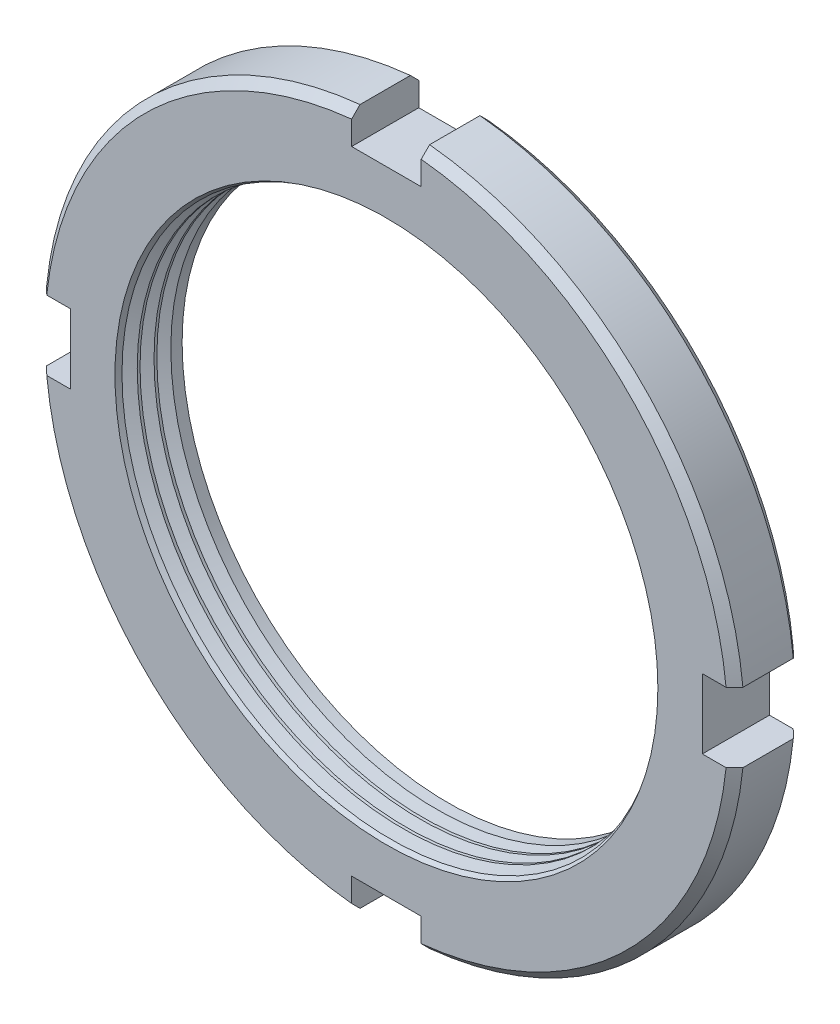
ISO-10303-21;
HEADER;
FILE_DESCRIPTION(('STEP AP214'),'2;1');
FILE_NAME('part.step','',(''),(''),'','','');
FILE_SCHEMA(('AUTOMOTIVE_DESIGN { 1 0 10303 214 1 1 1 1 }'));
ENDSEC;
DATA;
#1=APPLICATION_CONTEXT('core data for automotive mechanical design processes');
#2=APPLICATION_PROTOCOL_DEFINITION('international standard','automotive_design',2000,#1);
#3=PRODUCT_CONTEXT('',#1,'mechanical');
#4=PRODUCT('Part','Part','',(#3));
#5=PRODUCT_RELATED_PRODUCT_CATEGORY('part','',(#4));
#6=PRODUCT_DEFINITION_FORMATION('','',#4);
#7=PRODUCT_DEFINITION_CONTEXT('part definition',#1,'design');
#8=PRODUCT_DEFINITION('design','',#6,#7);
#9=PRODUCT_DEFINITION_SHAPE('','',#8);
#10=(LENGTH_UNIT() NAMED_UNIT(*) SI_UNIT(.MILLI.,.METRE.));
#11=(NAMED_UNIT(*) PLANE_ANGLE_UNIT() SI_UNIT($,.RADIAN.));
#12=(NAMED_UNIT(*) SI_UNIT($,.STERADIAN.) SOLID_ANGLE_UNIT());
#13=UNCERTAINTY_MEASURE_WITH_UNIT(LENGTH_MEASURE(1.E-05),#10,'distance_accuracy_value','');
#14=(GEOMETRIC_REPRESENTATION_CONTEXT(3) GLOBAL_UNCERTAINTY_ASSIGNED_CONTEXT((#13)) GLOBAL_UNIT_ASSIGNED_CONTEXT((#10,
#11,#12)) REPRESENTATION_CONTEXT('',''));
#15=CARTESIAN_POINT('',(0.,0.,0.));
#16=DIRECTION('',(0.,0.,1.));
#17=DIRECTION('',(1.,0.,0.));
#18=AXIS2_PLACEMENT_3D('',#15,#16,#17);
#19=CARTESIAN_POINT('',(0.,0.,-12.));
#20=DIRECTION('',(0.,0.,1.));
#21=DIRECTION('',(1.,0.,0.));
#22=AXIS2_PLACEMENT_3D('',#19,#20,#21);
#23=CYLINDRICAL_SURFACE('',#22,47.5);
#24=CARTESIAN_POINT('',(0.,0.,-5.98205080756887));
#25=DIRECTION('',(0.,0.,-1.));
#26=DIRECTION('',(-1.,0.,0.));
#27=AXIS2_PLACEMENT_3D('',#24,#25,#26);
#28=CIRCLE('',#27,47.5);
#29=CARTESIAN_POINT('',(-47.5,0.,-5.98205080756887));
#30=VERTEX_POINT('',#29);
#31=EDGE_CURVE('E596',#30,#30,#28,.T.);
#32=ORIENTED_EDGE('',*,*,#31,.F.);
#33=EDGE_LOOP('',(#32));
#34=FACE_BOUND('',#33,.T.);
#35=CARTESIAN_POINT('',(0.,0.,-6.48205080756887));
#36=DIRECTION('',(0.,0.,-1.));
#37=DIRECTION('',(-1.,0.,0.));
#38=AXIS2_PLACEMENT_3D('',#35,#36,#37);
#39=CIRCLE('',#38,47.5);
#40=CARTESIAN_POINT('',(-47.5,0.,-6.48205080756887));
#41=VERTEX_POINT('',#40);
#42=EDGE_CURVE('E601',#41,#41,#39,.T.);
#43=ORIENTED_EDGE('',*,*,#42,.T.);
#44=EDGE_LOOP('',(#43));
#45=FACE_BOUND('',#44,.T.);
#46=ADVANCED_FACE('F34',(#34,#45),#23,.F.);
#47=CARTESIAN_POINT('',(0.,0.,-11.));
#48=DIRECTION('',(0.,0.,1.));
#49=DIRECTION('',(1.,0.,0.));
#50=AXIS2_PLACEMENT_3D('',#47,#48,#49);
#51=CIRCLE('',#50,47.5);
#52=CARTESIAN_POINT('',(47.5,0.,-11.));
#53=VERTEX_POINT('',#52);
#54=EDGE_CURVE('E422',#53,#53,#51,.F.);
#55=ORIENTED_EDGE('',*,*,#54,.T.);
#56=EDGE_LOOP('',(#55));
#57=FACE_BOUND('',#56,.T.);
#58=CARTESIAN_POINT('',(0.,0.,-8.98205080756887));
#59=DIRECTION('',(0.,0.,-1.));
#60=DIRECTION('',(-1.,0.,0.));
#61=AXIS2_PLACEMENT_3D('',#58,#59,#60);
#62=CIRCLE('',#61,47.5);
#63=CARTESIAN_POINT('',(-47.5,0.,-8.98205080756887));
#64=VERTEX_POINT('',#63);
#65=EDGE_CURVE('E607',#64,#64,#62,.T.);
#66=ORIENTED_EDGE('',*,*,#65,.F.);
#67=EDGE_LOOP('',(#66));
#68=FACE_BOUND('',#67,.T.);
#69=ADVANCED_FACE('F571',(#57,#68),#23,.F.);
#70=CARTESIAN_POINT('',(0.,0.,-2.98205080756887));
#71=DIRECTION('',(0.,0.,-1.));
#72=DIRECTION('',(-1.,0.,0.));
#73=AXIS2_PLACEMENT_3D('',#70,#71,#72);
#74=CIRCLE('',#73,47.5);
#75=CARTESIAN_POINT('',(-47.5,0.,-2.98205080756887));
#76=VERTEX_POINT('',#75);
#77=EDGE_CURVE('E588',#76,#76,#74,.T.);
#78=ORIENTED_EDGE('',*,*,#77,.F.);
#79=EDGE_LOOP('',(#78));
#80=FACE_BOUND('',#79,.T.);
#81=CARTESIAN_POINT('',(0.,0.,-3.48205080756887));
#82=DIRECTION('',(0.,0.,-1.));
#83=DIRECTION('',(-1.,0.,0.));
#84=AXIS2_PLACEMENT_3D('',#81,#82,#83);
#85=CIRCLE('',#84,47.5);
#86=CARTESIAN_POINT('',(-47.5,0.,-3.48205080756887));
#87=VERTEX_POINT('',#86);
#88=EDGE_CURVE('E591',#87,#87,#85,.T.);
#89=ORIENTED_EDGE('',*,*,#88,.T.);
#90=EDGE_LOOP('',(#89));
#91=FACE_BOUND('',#90,.T.);
#92=ADVANCED_FACE('F565',(#80,#91),#23,.F.);
#93=CARTESIAN_POINT('',(0.,0.,-1.73205080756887));
#94=DIRECTION('',(0.,0.,1.));
#95=DIRECTION('',(1.,0.,0.));
#96=AXIS2_PLACEMENT_3D('',#93,#94,#95);
#97=CONICAL_SURFACE('',#96,47.5,0.523598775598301);
#98=CARTESIAN_POINT('',(0.,0.,0.));
#99=DIRECTION('',(0.,0.,1.));
#100=DIRECTION('',(1.,0.,0.));
#101=AXIS2_PLACEMENT_3D('',#98,#99,#100);
#102=CIRCLE('',#101,48.5);
#103=CARTESIAN_POINT('',(48.5,0.,0.));
#104=VERTEX_POINT('',#103);
#105=EDGE_CURVE('E426',#104,#104,#102,.F.);
#106=ORIENTED_EDGE('',*,*,#105,.F.);
#107=EDGE_LOOP('',(#106));
#108=FACE_BOUND('',#107,.T.);
#109=CARTESIAN_POINT('',(0.,0.,-0.794550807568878));
#110=DIRECTION('',(0.,0.,-1.));
#111=DIRECTION('',(-1.,0.,0.));
#112=AXIS2_PLACEMENT_3D('',#109,#110,#111);
#113=CIRCLE('',#112,48.0412658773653);
#114=CARTESIAN_POINT('',(-48.0412658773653,0.,-0.794550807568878));
#115=VERTEX_POINT('',#114);
#116=EDGE_CURVE('E38',#115,#115,#113,.T.);
#117=ORIENTED_EDGE('',*,*,#116,.T.);
#118=EDGE_LOOP('',(#117));
#119=FACE_BOUND('',#118,.T.);
#120=ADVANCED_FACE('F281',(#108,#119),#97,.F.);
#121=CARTESIAN_POINT('',(0.,0.,-12.));
#122=DIRECTION('',(0.,0.,1.));
#123=DIRECTION('',(1.,0.,0.));
#124=AXIS2_PLACEMENT_3D('',#121,#122,#123);
#125=CYLINDRICAL_SURFACE('',#124,62.5);
#126=DIRECTION('',(0.,0.,1.));
#127=VECTOR('',#126,1.);
#128=CARTESIAN_POINT('',(62.19022250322,-6.21499999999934,-12.));
#129=LINE('',#128,#127);
#130=CARTESIAN_POINT('',(62.19022250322,-6.21499999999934,-10.4999999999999));
#131=VERTEX_POINT('',#130);
#132=CARTESIAN_POINT('',(62.19022250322,-6.21499999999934,-1.49999999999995));
#133=VERTEX_POINT('',#132);
#134=EDGE_CURVE('E232',#131,#133,#129,.T.);
#135=ORIENTED_EDGE('',*,*,#134,.T.);
#136=CARTESIAN_POINT('',(0.,0.,-1.49999999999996));
#137=DIRECTION('',(0.,0.,1.));
#138=DIRECTION('',(1.,0.,0.));
#139=AXIS2_PLACEMENT_3D('',#136,#137,#138);
#140=CIRCLE('',#139,62.5);
#141=CARTESIAN_POINT('',(6.21500000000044,-62.1902225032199,-1.49999999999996));
#142=VERTEX_POINT('',#141);
#143=EDGE_CURVE('E58',#133,#142,#140,.F.);
#144=ORIENTED_EDGE('',*,*,#143,.T.);
#145=DIRECTION('',(0.,0.,1.));
#146=VECTOR('',#145,1.);
#147=CARTESIAN_POINT('',(6.21500000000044,-62.1902225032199,-12.));
#148=LINE('',#147,#146);
#149=CARTESIAN_POINT('',(6.21500000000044,-62.1902225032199,-10.4999999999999));
#150=VERTEX_POINT('',#149);
#151=EDGE_CURVE('E338',#150,#142,#148,.T.);
#152=ORIENTED_EDGE('',*,*,#151,.F.);
#153=CARTESIAN_POINT('',(0.,0.,-10.4999999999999));
#154=DIRECTION('',(0.,0.,1.));
#155=DIRECTION('',(1.,0.,0.));
#156=AXIS2_PLACEMENT_3D('',#153,#154,#155);
#157=CIRCLE('',#156,62.5);
#158=EDGE_CURVE('E535',#150,#131,#157,.T.);
#159=ORIENTED_EDGE('',*,*,#158,.T.);
#160=EDGE_LOOP('',(#135,#144,#152,#159));
#161=FACE_BOUND('',#160,.T.);
#162=ADVANCED_FACE('F559',(#161),#125,.T.);
#163=CARTESIAN_POINT('',(0.,0.,-10.4999999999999));
#164=DIRECTION('',(0.,0.,1.));
#165=DIRECTION('',(1.,0.,0.));
#166=AXIS2_PLACEMENT_3D('',#163,#164,#165);
#167=CONICAL_SURFACE('',#166,62.5,0.785398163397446);
#168=CARTESIAN_POINT('',(68.7302677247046,-6.21499999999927,-3.98930570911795));
#169=CARTESIAN_POINT('',(67.3974966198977,-6.21499999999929,-5.31665587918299));
#170=CARTESIAN_POINT('',(66.0645740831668,-6.2149999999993,-6.64385403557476));
#171=CARTESIAN_POINT('',(63.398353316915,-6.21499999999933,-9.29787259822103));
#172=CARTESIAN_POINT('',(62.0650550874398,-6.21499999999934,-10.6246930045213));
#173=CARTESIAN_POINT('',(59.3980097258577,-6.21499999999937,-13.2778827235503));
#174=CARTESIAN_POINT('',(58.0642625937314,-6.21499999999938,-14.6042520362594));
#175=CARTESIAN_POINT('',(55.396210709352,-6.21499999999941,-17.2564300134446));
#176=CARTESIAN_POINT('',(54.0619059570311,-6.21499999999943,-18.5822386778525));
#177=CARTESIAN_POINT('',(52.7272681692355,-6.21499999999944,-19.9077121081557));
#178=B_SPLINE_CURVE_WITH_KNOTS('',3,(#168,#169,#170,#171,#172,#173,#174,#175,#176,#177),
.UNSPECIFIED.,.F.,.F.,(4,2,2,2,4),(0.,5.64298111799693,11.2859615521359,16.9289422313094,
22.5719235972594),.UNSPECIFIED.);
#179=CARTESIAN_POINT('',(60.6825656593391,-6.21499999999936,-12.));
#180=VERTEX_POINT('',#179);
#181=EDGE_CURVE('E243',#131,#180,#178,.T.);
#182=ORIENTED_EDGE('',*,*,#181,.F.);
#183=ORIENTED_EDGE('',*,*,#158,.F.);
#184=CARTESIAN_POINT('',(6.21500000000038,-53.4503772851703,-19.1895079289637));
#185=CARTESIAN_POINT('',(6.21500000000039,-54.7848933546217,-17.8639119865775));
#186=CARTESIAN_POINT('',(6.2150000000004,-56.1190893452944,-16.537993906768));
#187=CARTESIAN_POINT('',(6.21500000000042,-58.7869443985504,-13.8856179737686));
#188=CARTESIAN_POINT('',(6.21500000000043,-60.1206034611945,-12.5591601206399));
#189=CARTESIAN_POINT('',(6.21500000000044,-62.7874881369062,-9.90580889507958));
#190=CARTESIAN_POINT('',(6.21500000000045,-64.1207137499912,-8.57891552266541));
#191=CARTESIAN_POINT('',(6.21500000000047,-66.7868015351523,-5.92476339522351));
#192=CARTESIAN_POINT('',(6.21500000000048,-68.1196637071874,-4.59750464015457));
#193=CARTESIAN_POINT('',(6.21500000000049,-69.4523789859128,-3.27009843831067));
#194=B_SPLINE_CURVE_WITH_KNOTS('',3,(#184,#185,#186,#187,#188,#189,#190,#191,#192,#193),
.UNSPECIFIED.,.F.,.F.,(4,2,2,2,4),(0.,5.64298130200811,11.2859619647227,16.9289424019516,
22.5719234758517),.UNSPECIFIED.);
#195=CARTESIAN_POINT('',(6.21500000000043,-60.682565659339,-12.));
#196=VERTEX_POINT('',#195);
#197=EDGE_CURVE('E330',#196,#150,#194,.T.);
#198=ORIENTED_EDGE('',*,*,#197,.F.);
#199=CARTESIAN_POINT('',(0.,0.,-12.));
#200=DIRECTION('',(0.,0.,1.));
#201=DIRECTION('',(1.,0.,0.));
#202=AXIS2_PLACEMENT_3D('',#199,#200,#201);
#203=CIRCLE('',#202,60.9999999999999);
#204=EDGE_CURVE('E418',#180,#196,#203,.F.);
#205=ORIENTED_EDGE('',*,*,#204,.F.);
#206=EDGE_LOOP('',(#182,#183,#198,#205));
#207=FACE_BOUND('',#206,.T.);
#208=ADVANCED_FACE('F533',(#207),#167,.T.);
#209=CARTESIAN_POINT('',(0.,0.,0.));
#210=DIRECTION('',(0.,0.,-1.));
#211=DIRECTION('',(-1.,0.,0.));
#212=AXIS2_PLACEMENT_3D('',#209,#210,#211);
#213=CONICAL_SURFACE('',#212,61.0000000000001,0.785398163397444);
#214=CARTESIAN_POINT('',(52.7272681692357,-6.21499999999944,7.90771210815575));
#215=CARTESIAN_POINT('',(54.0619059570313,-6.21499999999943,6.58223867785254));
#216=CARTESIAN_POINT('',(55.3962107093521,-6.21499999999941,5.25643001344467));
#217=CARTESIAN_POINT('',(58.0642625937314,-6.21499999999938,2.60425203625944));
#218=CARTESIAN_POINT('',(59.3980097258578,-6.21499999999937,1.27788272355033));
#219=CARTESIAN_POINT('',(62.0650550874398,-6.21499999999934,-1.37530699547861));
#220=CARTESIAN_POINT('',(63.398353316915,-6.21499999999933,-2.70212740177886));
#221=CARTESIAN_POINT('',(66.0645740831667,-6.2149999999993,-5.35614596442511));
#222=CARTESIAN_POINT('',(67.3974966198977,-6.21499999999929,-6.68334412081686));
#223=CARTESIAN_POINT('',(68.7302677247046,-6.21499999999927,-8.0106942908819));
#224=B_SPLINE_CURVE_WITH_KNOTS('',3,(#214,#215,#216,#217,#218,#219,#220,#221,#222,#223),
.UNSPECIFIED.,.F.,.F.,(4,2,2,2,4),(0.,5.64298136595,11.2859620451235,16.9289424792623,
22.5719235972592),.UNSPECIFIED.);
#225=CARTESIAN_POINT('',(60.6825656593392,-6.21499999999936,0.));
#226=VERTEX_POINT('',#225);
#227=EDGE_CURVE('E11',#226,#133,#224,.T.);
#228=ORIENTED_EDGE('',*,*,#227,.F.);
#229=CARTESIAN_POINT('',(0.,0.,0.));
#230=DIRECTION('',(0.,0.,1.));
#231=DIRECTION('',(1.,0.,0.));
#232=AXIS2_PLACEMENT_3D('',#229,#230,#231);
#233=CIRCLE('',#232,61.0000000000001);
#234=CARTESIAN_POINT('',(6.21500000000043,-60.6825656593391,0.));
#235=VERTEX_POINT('',#234);
#236=EDGE_CURVE('E470',#235,#226,#233,.T.);
#237=ORIENTED_EDGE('',*,*,#236,.F.);
#238=CARTESIAN_POINT('',(6.21500000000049,-69.4523789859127,-8.72990156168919));
#239=CARTESIAN_POINT('',(6.21500000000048,-68.1196637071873,-7.40249535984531));
#240=CARTESIAN_POINT('',(6.21500000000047,-66.7868015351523,-6.07523660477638));
#241=CARTESIAN_POINT('',(6.21500000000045,-64.1207137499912,-3.4210844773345));
#242=CARTESIAN_POINT('',(6.21500000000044,-62.7874881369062,-2.09419110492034));
#243=CARTESIAN_POINT('',(6.21500000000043,-60.1206034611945,0.559160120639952));
#244=CARTESIAN_POINT('',(6.21500000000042,-58.7869443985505,1.88561797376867));
#245=CARTESIAN_POINT('',(6.2150000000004,-56.1190893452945,4.53799390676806));
#246=CARTESIAN_POINT('',(6.21500000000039,-54.7848933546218,5.86391198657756));
#247=CARTESIAN_POINT('',(6.21500000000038,-53.4503772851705,7.18950792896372));
#248=B_SPLINE_CURVE_WITH_KNOTS('',3,(#238,#239,#240,#241,#242,#243,#244,#245,#246,#247),
.UNSPECIFIED.,.F.,.F.,(4,2,2,2,4),(0.,5.64298107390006,11.2859615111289,16.9289421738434,
22.5719234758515),.UNSPECIFIED.);
#249=EDGE_CURVE('E314',#142,#235,#248,.T.);
#250=ORIENTED_EDGE('',*,*,#249,.F.);
#251=ORIENTED_EDGE('',*,*,#143,.F.);
#252=EDGE_LOOP('',(#228,#237,#250,#251));
#253=FACE_BOUND('',#252,.T.);
#254=ADVANCED_FACE('F279',(#253),#213,.T.);
#255=DIRECTION('',(0.,0.,1.));
#256=VECTOR('',#255,1.);
#257=CARTESIAN_POINT('',(-6.21499999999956,-62.1902225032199,-12.));
#258=LINE('',#257,#256);
#259=CARTESIAN_POINT('',(-6.21499999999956,-62.1902225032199,-10.4999999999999));
#260=VERTEX_POINT('',#259);
#261=CARTESIAN_POINT('',(-6.21499999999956,-62.1902225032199,-1.49999999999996));
#262=VERTEX_POINT('',#261);
#263=EDGE_CURVE('E337',#260,#262,#258,.T.);
#264=ORIENTED_EDGE('',*,*,#263,.T.);
#265=CARTESIAN_POINT('',(-62.1902225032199,-6.21500000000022,-1.49999999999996));
#266=VERTEX_POINT('',#265);
#267=EDGE_CURVE('E453',#262,#266,#140,.F.);
#268=ORIENTED_EDGE('',*,*,#267,.T.);
#269=DIRECTION('',(0.,0.,1.));
#270=VECTOR('',#269,1.);
#271=CARTESIAN_POINT('',(-62.1902225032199,-6.21500000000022,-12.));
#272=LINE('',#271,#270);
#273=CARTESIAN_POINT('',(-62.1902225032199,-6.21500000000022,-10.4999999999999));
#274=VERTEX_POINT('',#273);
#275=EDGE_CURVE('E355',#274,#266,#272,.T.);
#276=ORIENTED_EDGE('',*,*,#275,.F.);
#277=EDGE_CURVE('E415',#274,#260,#157,.T.);
#278=ORIENTED_EDGE('',*,*,#277,.T.);
#279=EDGE_LOOP('',(#264,#268,#276,#278));
#280=FACE_BOUND('',#279,.T.);
#281=ADVANCED_FACE('F458',(#280),#125,.T.);
#282=CARTESIAN_POINT('',(-6.21499999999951,-69.4523789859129,-3.27009843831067));
#283=CARTESIAN_POINT('',(-6.21499999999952,-68.1196637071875,-4.59750464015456));
#284=CARTESIAN_POINT('',(-6.21499999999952,-66.7868015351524,-5.9247633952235));
#285=CARTESIAN_POINT('',(-6.21499999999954,-64.1207137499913,-8.5789155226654));
#286=CARTESIAN_POINT('',(-6.21499999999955,-62.7874881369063,-9.90580889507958));
#287=CARTESIAN_POINT('',(-6.21499999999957,-60.1206034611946,-12.5591601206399));
#288=CARTESIAN_POINT('',(-6.21499999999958,-58.7869443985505,-13.8856179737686));
#289=CARTESIAN_POINT('',(-6.2149999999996,-56.1190893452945,-16.537993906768));
#290=CARTESIAN_POINT('',(-6.21499999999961,-54.7848933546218,-17.8639119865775));
#291=CARTESIAN_POINT('',(-6.21499999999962,-53.4503772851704,-19.1895079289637));
#292=B_SPLINE_CURVE_WITH_KNOTS('',3,(#282,#283,#284,#285,#286,#287,#288,#289,#290,#291),
.UNSPECIFIED.,.F.,.F.,(4,2,2,2,4),(0.,5.64298107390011,11.285961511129,16.9289421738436,
22.5719234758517),.UNSPECIFIED.);
#293=CARTESIAN_POINT('',(-6.21499999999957,-60.6825656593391,-12.));
#294=VERTEX_POINT('',#293);
#295=EDGE_CURVE('E336',#260,#294,#292,.T.);
#296=ORIENTED_EDGE('',*,*,#295,.F.);
#297=ORIENTED_EDGE('',*,*,#277,.F.);
#298=CARTESIAN_POINT('',(-53.4503772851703,-6.21500000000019,-19.1895079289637));
#299=CARTESIAN_POINT('',(-54.7848933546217,-6.2150000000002,-17.8639119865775));
#300=CARTESIAN_POINT('',(-56.1190893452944,-6.2150000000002,-16.537993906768));
#301=CARTESIAN_POINT('',(-58.7869443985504,-6.21500000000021,-13.8856179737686));
#302=CARTESIAN_POINT('',(-60.1206034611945,-6.21500000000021,-12.5591601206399));
#303=CARTESIAN_POINT('',(-62.7874881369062,-6.21500000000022,-9.90580889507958));
#304=CARTESIAN_POINT('',(-64.1207137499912,-6.21500000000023,-8.57891552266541));
#305=CARTESIAN_POINT('',(-66.7868015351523,-6.21500000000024,-5.9247633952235));
#306=CARTESIAN_POINT('',(-68.1196637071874,-6.21500000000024,-4.59750464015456));
#307=CARTESIAN_POINT('',(-69.4523789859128,-6.21500000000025,-3.27009843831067));
#308=B_SPLINE_CURVE_WITH_KNOTS('',3,(#298,#299,#300,#301,#302,#303,#304,#305,#306,#307),
.UNSPECIFIED.,.F.,.F.,(4,2,2,2,4),(0.,5.64298130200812,11.2859619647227,16.9289424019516,
22.5719234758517),.UNSPECIFIED.);
#309=CARTESIAN_POINT('',(-60.682565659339,-6.21500000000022,-12.));
#310=VERTEX_POINT('',#309);
#311=EDGE_CURVE('E364',#310,#274,#308,.T.);
#312=ORIENTED_EDGE('',*,*,#311,.F.);
#313=EDGE_CURVE('E516',#294,#310,#203,.F.);
#314=ORIENTED_EDGE('',*,*,#313,.F.);
#315=EDGE_LOOP('',(#296,#297,#312,#314));
#316=FACE_BOUND('',#315,.T.);
#317=ADVANCED_FACE('F538',(#316),#167,.T.);
#318=CARTESIAN_POINT('',(-6.21499999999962,-53.4503772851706,7.18950792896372));
#319=CARTESIAN_POINT('',(-6.21499999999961,-54.7848933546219,5.86391198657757));
#320=CARTESIAN_POINT('',(-6.2149999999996,-56.1190893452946,4.53799390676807));
#321=CARTESIAN_POINT('',(-6.21499999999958,-58.7869443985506,1.88561797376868));
#322=CARTESIAN_POINT('',(-6.21499999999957,-60.1206034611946,0.559160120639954));
#323=CARTESIAN_POINT('',(-6.21499999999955,-62.7874881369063,-2.09419110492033));
#324=CARTESIAN_POINT('',(-6.21499999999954,-64.1207137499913,-3.4210844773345));
#325=CARTESIAN_POINT('',(-6.21499999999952,-66.7868015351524,-6.07523660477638));
#326=CARTESIAN_POINT('',(-6.21499999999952,-68.1196637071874,-7.4024953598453));
#327=CARTESIAN_POINT('',(-6.21499999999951,-69.4523789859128,-8.72990156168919));
#328=B_SPLINE_CURVE_WITH_KNOTS('',3,(#318,#319,#320,#321,#322,#323,#324,#325,#326,#327),
.UNSPECIFIED.,.F.,.F.,(4,2,2,2,4),(0.,5.64298130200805,11.2859619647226,16.9289424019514,
22.5719234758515),.UNSPECIFIED.);
#329=CARTESIAN_POINT('',(-6.21499999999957,-60.6825656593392,0.));
#330=VERTEX_POINT('',#329);
#331=EDGE_CURVE('E267',#330,#262,#328,.T.);
#332=ORIENTED_EDGE('',*,*,#331,.F.);
#333=CARTESIAN_POINT('',(-60.6825656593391,-6.21500000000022,0.));
#334=VERTEX_POINT('',#333);
#335=EDGE_CURVE('E423',#334,#330,#233,.T.);
#336=ORIENTED_EDGE('',*,*,#335,.F.);
#337=CARTESIAN_POINT('',(-69.4523789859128,-6.21500000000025,-8.72990156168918));
#338=CARTESIAN_POINT('',(-68.1196637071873,-6.21500000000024,-7.4024953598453));
#339=CARTESIAN_POINT('',(-66.7868015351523,-6.21500000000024,-6.07523660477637));
#340=CARTESIAN_POINT('',(-64.1207137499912,-6.21500000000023,-3.42108447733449));
#341=CARTESIAN_POINT('',(-62.7874881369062,-6.21500000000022,-2.09419110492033));
#342=CARTESIAN_POINT('',(-60.1206034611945,-6.21500000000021,0.559160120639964));
#343=CARTESIAN_POINT('',(-58.7869443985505,-6.21500000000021,1.88561797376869));
#344=CARTESIAN_POINT('',(-56.1190893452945,-6.2150000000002,4.53799390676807));
#345=CARTESIAN_POINT('',(-54.7848933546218,-6.2150000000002,5.86391198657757));
#346=CARTESIAN_POINT('',(-53.4503772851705,-6.21500000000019,7.18950792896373));
#347=B_SPLINE_CURVE_WITH_KNOTS('',3,(#337,#338,#339,#340,#341,#342,#343,#344,#345,#346),
.UNSPECIFIED.,.F.,.F.,(4,2,2,2,4),(0.,5.64298107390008,11.2859615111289,16.9289421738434,
22.5719234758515),.UNSPECIFIED.);
#348=EDGE_CURVE('E301',#266,#334,#347,.T.);
#349=ORIENTED_EDGE('',*,*,#348,.F.);
#350=ORIENTED_EDGE('',*,*,#267,.F.);
#351=EDGE_LOOP('',(#332,#336,#349,#350));
#352=FACE_BOUND('',#351,.T.);
#353=ADVANCED_FACE('F466',(#352),#213,.T.);
#354=DIRECTION('',(0.,0.,1.));
#355=VECTOR('',#354,1.);
#356=CARTESIAN_POINT('',(-62.1902225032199,6.21499999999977,-12.));
#357=LINE('',#356,#355);
#358=CARTESIAN_POINT('',(-62.1902225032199,6.21499999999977,-10.4999999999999));
#359=VERTEX_POINT('',#358);
#360=CARTESIAN_POINT('',(-62.1902225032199,6.21499999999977,-1.49999999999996));
#361=VERTEX_POINT('',#360);
#362=EDGE_CURVE('E361',#359,#361,#357,.T.);
#363=ORIENTED_EDGE('',*,*,#362,.T.);
#364=CARTESIAN_POINT('',(-6.21500000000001,62.1902225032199,-1.49999999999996));
#365=VERTEX_POINT('',#364);
#366=EDGE_CURVE('E401',#361,#365,#140,.F.);
#367=ORIENTED_EDGE('',*,*,#366,.T.);
#368=DIRECTION('',(0.,0.,1.));
#369=VECTOR('',#368,1.);
#370=CARTESIAN_POINT('',(-6.21500000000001,62.1902225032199,-12.));
#371=LINE('',#370,#369);
#372=CARTESIAN_POINT('',(-6.21500000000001,62.1902225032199,-10.4999999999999));
#373=VERTEX_POINT('',#372);
#374=EDGE_CURVE('E499',#373,#365,#371,.T.);
#375=ORIENTED_EDGE('',*,*,#374,.F.);
#376=EDGE_CURVE('E411',#373,#359,#157,.T.);
#377=ORIENTED_EDGE('',*,*,#376,.T.);
#378=EDGE_LOOP('',(#363,#367,#375,#377));
#379=FACE_BOUND('',#378,.T.);
#380=ADVANCED_FACE('F450',(#379),#125,.T.);
#381=CARTESIAN_POINT('',(-69.4523789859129,6.21499999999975,-3.27009843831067));
#382=CARTESIAN_POINT('',(-68.1196637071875,6.21499999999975,-4.59750464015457));
#383=CARTESIAN_POINT('',(-66.7868015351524,6.21499999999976,-5.9247633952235));
#384=CARTESIAN_POINT('',(-64.1207137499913,6.21499999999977,-8.5789155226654));
#385=CARTESIAN_POINT('',(-62.7874881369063,6.21499999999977,-9.90580889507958));
#386=CARTESIAN_POINT('',(-60.1206034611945,6.21499999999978,-12.5591601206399));
#387=CARTESIAN_POINT('',(-58.7869443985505,6.21499999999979,-13.8856179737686));
#388=CARTESIAN_POINT('',(-56.1190893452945,6.2149999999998,-16.537993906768));
#389=CARTESIAN_POINT('',(-54.7848933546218,6.2149999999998,-17.8639119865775));
#390=CARTESIAN_POINT('',(-53.4503772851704,6.2149999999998,-19.1895079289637));
#391=B_SPLINE_CURVE_WITH_KNOTS('',3,(#381,#382,#383,#384,#385,#386,#387,#388,#389,#390),
.UNSPECIFIED.,.F.,.F.,(4,2,2,2,4),(0.,5.64298107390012,11.285961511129,16.9289421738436,
22.5719234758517),.UNSPECIFIED.);
#392=CARTESIAN_POINT('',(-60.6825656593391,6.21499999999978,-12.));
#393=VERTEX_POINT('',#392);
#394=EDGE_CURVE('E376',#359,#393,#391,.T.);
#395=ORIENTED_EDGE('',*,*,#394,.F.);
#396=ORIENTED_EDGE('',*,*,#376,.F.);
#397=CARTESIAN_POINT('',(-6.21500000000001,52.7272681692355,-19.9077121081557));
#398=CARTESIAN_POINT('',(-6.21500000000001,54.0619059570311,-18.5822386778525));
#399=CARTESIAN_POINT('',(-6.21500000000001,55.3962107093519,-17.2564300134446));
#400=CARTESIAN_POINT('',(-6.21500000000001,58.0642625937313,-14.6042520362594));
#401=CARTESIAN_POINT('',(-6.21500000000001,59.3980097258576,-13.2778827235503));
#402=CARTESIAN_POINT('',(-6.21500000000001,62.0650550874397,-10.6246930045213));
#403=CARTESIAN_POINT('',(-6.21500000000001,63.398353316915,-9.29787259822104));
#404=CARTESIAN_POINT('',(-6.21500000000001,66.0645740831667,-6.64385403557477));
#405=CARTESIAN_POINT('',(-6.21500000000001,67.3974966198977,-5.31665587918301));
#406=CARTESIAN_POINT('',(-6.21500000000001,68.7302677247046,-3.98930570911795));
#407=B_SPLINE_CURVE_WITH_KNOTS('',3,(#397,#398,#399,#400,#401,#402,#403,#404,#405,#406),
.UNSPECIFIED.,.F.,.F.,(4,2,2,2,4),(0.,5.64298136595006,11.2859620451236,16.9289424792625,
22.5719235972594),.UNSPECIFIED.);
#408=CARTESIAN_POINT('',(-6.21500000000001,60.682565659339,-12.));
#409=VERTEX_POINT('',#408);
#410=EDGE_CURVE('E402',#409,#373,#407,.T.);
#411=ORIENTED_EDGE('',*,*,#410,.F.);
#412=EDGE_CURVE('E414',#393,#409,#203,.F.);
#413=ORIENTED_EDGE('',*,*,#412,.F.);
#414=EDGE_LOOP('',(#395,#396,#411,#413));
#415=FACE_BOUND('',#414,.T.);
#416=ADVANCED_FACE('F792',(#415),#167,.T.);
#417=CARTESIAN_POINT('',(-53.4503772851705,6.2149999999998,7.18950792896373));
#418=CARTESIAN_POINT('',(-54.7848933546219,6.2149999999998,5.86391198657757));
#419=CARTESIAN_POINT('',(-56.1190893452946,6.2149999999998,4.53799390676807));
#420=CARTESIAN_POINT('',(-58.7869443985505,6.21499999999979,1.88561797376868));
#421=CARTESIAN_POINT('',(-60.1206034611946,6.21499999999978,0.559160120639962));
#422=CARTESIAN_POINT('',(-62.7874881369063,6.21499999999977,-2.09419110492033));
#423=CARTESIAN_POINT('',(-64.1207137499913,6.21499999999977,-3.42108447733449));
#424=CARTESIAN_POINT('',(-66.7868015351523,6.21499999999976,-6.07523660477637));
#425=CARTESIAN_POINT('',(-68.1196637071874,6.21499999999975,-7.4024953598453));
#426=CARTESIAN_POINT('',(-69.4523789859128,6.21499999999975,-8.72990156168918));
#427=B_SPLINE_CURVE_WITH_KNOTS('',3,(#417,#418,#419,#420,#421,#422,#423,#424,#425,#426),
.UNSPECIFIED.,.F.,.F.,(4,2,2,2,4),(0.,5.64298130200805,11.2859619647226,16.9289424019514,
22.5719234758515),.UNSPECIFIED.);
#428=CARTESIAN_POINT('',(-60.6825656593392,6.21499999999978,0.));
#429=VERTEX_POINT('',#428);
#430=EDGE_CURVE('E308',#429,#361,#427,.T.);
#431=ORIENTED_EDGE('',*,*,#430,.F.);
#432=CARTESIAN_POINT('',(-6.21500000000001,60.6825656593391,0.));
#433=VERTEX_POINT('',#432);
#434=EDGE_CURVE('E419',#433,#429,#233,.T.);
#435=ORIENTED_EDGE('',*,*,#434,.F.);
#436=CARTESIAN_POINT('',(-6.21500000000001,68.7302677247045,-8.0106942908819));
#437=CARTESIAN_POINT('',(-6.21500000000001,67.3974966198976,-6.68334412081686));
#438=CARTESIAN_POINT('',(-6.21500000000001,66.0645740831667,-5.35614596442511));
#439=CARTESIAN_POINT('',(-6.21500000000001,63.398353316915,-2.70212740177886));
#440=CARTESIAN_POINT('',(-6.21500000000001,62.0650550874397,-1.37530699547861));
#441=CARTESIAN_POINT('',(-6.21500000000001,59.3980097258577,1.27788272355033));
#442=CARTESIAN_POINT('',(-6.21500000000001,58.0642625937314,2.60425203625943));
#443=CARTESIAN_POINT('',(-6.21500000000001,55.396210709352,5.25643001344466));
#444=CARTESIAN_POINT('',(-6.21500000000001,54.0619059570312,6.58223867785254));
#445=CARTESIAN_POINT('',(-6.21500000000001,52.7272681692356,7.90771210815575));
#446=B_SPLINE_CURVE_WITH_KNOTS('',3,(#436,#437,#438,#439,#440,#441,#442,#443,#444,#445),
.UNSPECIFIED.,.F.,.F.,(4,2,2,2,4),(0.,5.64298111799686,11.2859615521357,16.9289422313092,
22.5719235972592),.UNSPECIFIED.);
#447=EDGE_CURVE('E285',#365,#433,#446,.T.);
#448=ORIENTED_EDGE('',*,*,#447,.F.);
#449=ORIENTED_EDGE('',*,*,#366,.F.);
#450=EDGE_LOOP('',(#431,#435,#448,#449));
#451=FACE_BOUND('',#450,.T.);
#452=ADVANCED_FACE('F280',(#451),#213,.T.);
#453=DIRECTION('',(0.,0.,1.));
#454=VECTOR('',#453,1.);
#455=CARTESIAN_POINT('',(62.1902225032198,6.21500000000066,-12.));
#456=LINE('',#455,#454);
#457=CARTESIAN_POINT('',(62.1902225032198,6.21500000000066,-10.4999999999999));
#458=VERTEX_POINT('',#457);
#459=CARTESIAN_POINT('',(62.1902225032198,6.21500000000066,-1.49999999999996));
#460=VERTEX_POINT('',#459);
#461=EDGE_CURVE('E50',#458,#460,#456,.T.);
#462=ORIENTED_EDGE('',*,*,#461,.F.);
#463=CARTESIAN_POINT('',(6.21499999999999,62.1902225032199,-10.4999999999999));
#464=VERTEX_POINT('',#463);
#465=EDGE_CURVE('E410',#458,#464,#157,.T.);
#466=ORIENTED_EDGE('',*,*,#465,.T.);
#467=DIRECTION('',(0.,0.,1.));
#468=VECTOR('',#467,1.);
#469=CARTESIAN_POINT('',(6.21499999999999,62.1902225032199,-12.));
#470=LINE('',#469,#468);
#471=CARTESIAN_POINT('',(6.21499999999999,62.1902225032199,-1.49999999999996));
#472=VERTEX_POINT('',#471);
#473=EDGE_CURVE('E491',#464,#472,#470,.T.);
#474=ORIENTED_EDGE('',*,*,#473,.T.);
#475=EDGE_CURVE('E407',#472,#460,#140,.F.);
#476=ORIENTED_EDGE('',*,*,#475,.T.);
#477=EDGE_LOOP('',(#462,#466,#474,#476));
#478=FACE_BOUND('',#477,.T.);
#479=ADVANCED_FACE('F489',(#478),#125,.T.);
#480=CARTESIAN_POINT('',(0.,0.,-12.));
#481=DIRECTION('',(0.,0.,1.));
#482=DIRECTION('',(1.,0.,0.));
#483=AXIS2_PLACEMENT_3D('',#480,#481,#482);
#484=PLANE('',#483);
#485=CARTESIAN_POINT('',(0.,0.,-12.));
#486=DIRECTION('',(0.,0.,1.));
#487=DIRECTION('',(1.,0.,0.));
#488=AXIS2_PLACEMENT_3D('',#485,#486,#487);
#489=CIRCLE('',#488,49.2320508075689);
#490=CARTESIAN_POINT('',(49.2320508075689,0.,-12.));
#491=VERTEX_POINT('',#490);
#492=EDGE_CURVE('E428',#491,#491,#489,.T.);
#493=ORIENTED_EDGE('',*,*,#492,.T.);
#494=EDGE_LOOP('',(#493));
#495=FACE_BOUND('',#494,.T.);
#496=DIRECTION('',(0.,-1.,0.));
#497=VECTOR('',#496,1.);
#498=CARTESIAN_POINT('',(56.4402225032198,6.2150000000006,-12.));
#499=LINE('',#498,#497);
#500=CARTESIAN_POINT('',(56.4402225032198,6.2150000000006,-12.));
#501=VERTEX_POINT('',#500);
#502=CARTESIAN_POINT('',(56.44022250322,-6.2149999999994,-12.));
#503=VERTEX_POINT('',#502);
#504=EDGE_CURVE('E209',#501,#503,#499,.T.);
#505=ORIENTED_EDGE('',*,*,#504,.T.);
#506=DIRECTION('',(1.,0.,0.));
#507=VECTOR('',#506,1.);
#508=CARTESIAN_POINT('',(62.19022250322,-6.21499999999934,-12.));
#509=LINE('',#508,#507);
#510=EDGE_CURVE('E214',#503,#180,#509,.T.);
#511=ORIENTED_EDGE('',*,*,#510,.T.);
#512=ORIENTED_EDGE('',*,*,#204,.T.);
#513=DIRECTION('',(0.,1.,0.));
#514=VECTOR('',#513,1.);
#515=CARTESIAN_POINT('',(6.21500000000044,-62.1902225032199,-12.));
#516=LINE('',#515,#514);
#517=CARTESIAN_POINT('',(6.2150000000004,-56.4402225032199,-12.));
#518=VERTEX_POINT('',#517);
#519=EDGE_CURVE('E523',#196,#518,#516,.T.);
#520=ORIENTED_EDGE('',*,*,#519,.T.);
#521=DIRECTION('',(-1.,0.,0.));
#522=VECTOR('',#521,1.);
#523=CARTESIAN_POINT('',(6.2150000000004,-56.4402225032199,-12.));
#524=LINE('',#523,#522);
#525=CARTESIAN_POINT('',(-6.2149999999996,-56.4402225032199,-12.));
#526=VERTEX_POINT('',#525);
#527=EDGE_CURVE('E530',#518,#526,#524,.T.);
#528=ORIENTED_EDGE('',*,*,#527,.T.);
#529=DIRECTION('',(0.,-1.,0.));
#530=VECTOR('',#529,1.);
#531=CARTESIAN_POINT('',(-6.21499999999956,-62.1902225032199,-12.));
#532=LINE('',#531,#530);
#533=EDGE_CURVE('E541',#526,#294,#532,.T.);
#534=ORIENTED_EDGE('',*,*,#533,.T.);
#535=ORIENTED_EDGE('',*,*,#313,.T.);
#536=DIRECTION('',(1.,0.,0.));
#537=VECTOR('',#536,1.);
#538=CARTESIAN_POINT('',(-62.1902225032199,-6.21500000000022,-12.));
#539=LINE('',#538,#537);
#540=CARTESIAN_POINT('',(-56.4402225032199,-6.2150000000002,-12.));
#541=VERTEX_POINT('',#540);
#542=EDGE_CURVE('E345',#310,#541,#539,.T.);
#543=ORIENTED_EDGE('',*,*,#542,.T.);
#544=DIRECTION('',(0.,1.,0.));
#545=VECTOR('',#544,1.);
#546=CARTESIAN_POINT('',(-56.4402225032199,-6.2150000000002,-12.));
#547=LINE('',#546,#545);
#548=CARTESIAN_POINT('',(-56.4402225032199,6.21499999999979,-12.));
#549=VERTEX_POINT('',#548);
#550=EDGE_CURVE('E348',#541,#549,#547,.T.);
#551=ORIENTED_EDGE('',*,*,#550,.T.);
#552=DIRECTION('',(-1.,0.,0.));
#553=VECTOR('',#552,1.);
#554=CARTESIAN_POINT('',(-62.1902225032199,6.21499999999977,-12.));
#555=LINE('',#554,#553);
#556=EDGE_CURVE('E352',#549,#393,#555,.T.);
#557=ORIENTED_EDGE('',*,*,#556,.T.);
#558=ORIENTED_EDGE('',*,*,#412,.T.);
#559=DIRECTION('',(0.,-1.,0.));
#560=VECTOR('',#559,1.);
#561=CARTESIAN_POINT('',(-6.21500000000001,62.1902225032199,-12.));
#562=LINE('',#561,#560);
#563=CARTESIAN_POINT('',(-6.21500000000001,56.4402225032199,-12.));
#564=VERTEX_POINT('',#563);
#565=EDGE_CURVE('E484',#409,#564,#562,.T.);
#566=ORIENTED_EDGE('',*,*,#565,.T.);
#567=DIRECTION('',(1.,0.,0.));
#568=VECTOR('',#567,1.);
#569=CARTESIAN_POINT('',(-6.21500000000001,56.4402225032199,-12.));
#570=LINE('',#569,#568);
#571=CARTESIAN_POINT('',(6.21499999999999,56.4402225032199,-12.));
#572=VERTEX_POINT('',#571);
#573=EDGE_CURVE('E501',#564,#572,#570,.T.);
#574=ORIENTED_EDGE('',*,*,#573,.T.);
#575=DIRECTION('',(0.,1.,0.));
#576=VECTOR('',#575,1.);
#577=CARTESIAN_POINT('',(6.21499999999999,62.1902225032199,-12.));
#578=LINE('',#577,#576);
#579=CARTESIAN_POINT('',(6.21499999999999,60.682565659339,-12.));
#580=VERTEX_POINT('',#579);
#581=EDGE_CURVE('E500',#572,#580,#578,.T.);
#582=ORIENTED_EDGE('',*,*,#581,.T.);
#583=CARTESIAN_POINT('',(60.682565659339,6.21500000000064,-12.));
#584=VERTEX_POINT('',#583);
#585=EDGE_CURVE('E220',#580,#584,#203,.F.);
#586=ORIENTED_EDGE('',*,*,#585,.T.);
#587=DIRECTION('',(-1.,0.,0.));
#588=VECTOR('',#587,1.);
#589=CARTESIAN_POINT('',(62.1902225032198,6.21500000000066,-12.));
#590=LINE('',#589,#588);
#591=EDGE_CURVE('E199',#584,#501,#590,.T.);
#592=ORIENTED_EDGE('',*,*,#591,.T.);
#593=EDGE_LOOP('',(#505,#511,#512,#520,#528,#534,#535,#543,#551,#557,#558,#566,#574,#582,#586,#592));
#594=FACE_BOUND('',#593,.T.);
#595=ADVANCED_FACE('F217',(#495,#594),#484,.F.);
#596=CARTESIAN_POINT('',(0.,0.,0.));
#597=DIRECTION('',(0.,0.,1.));
#598=DIRECTION('',(1.,0.,0.));
#599=AXIS2_PLACEMENT_3D('',#596,#597,#598);
#600=PLANE('',#599);
#601=DIRECTION('',(1.,0.,0.));
#602=VECTOR('',#601,1.);
#603=CARTESIAN_POINT('',(62.19022250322,-6.21499999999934,0.));
#604=LINE('',#603,#602);
#605=CARTESIAN_POINT('',(56.44022250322,-6.2149999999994,0.));
#606=VERTEX_POINT('',#605);
#607=EDGE_CURVE('E221',#606,#226,#604,.T.);
#608=ORIENTED_EDGE('',*,*,#607,.F.);
#609=DIRECTION('',(0.,-1.,0.));
#610=VECTOR('',#609,1.);
#611=CARTESIAN_POINT('',(56.4402225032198,6.2150000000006,0.));
#612=LINE('',#611,#610);
#613=CARTESIAN_POINT('',(56.4402225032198,6.2150000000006,0.));
#614=VERTEX_POINT('',#613);
#615=EDGE_CURVE('E223',#614,#606,#612,.T.);
#616=ORIENTED_EDGE('',*,*,#615,.F.);
#617=DIRECTION('',(-1.,0.,0.));
#618=VECTOR('',#617,1.);
#619=CARTESIAN_POINT('',(62.1902225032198,6.21500000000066,0.));
#620=LINE('',#619,#618);
#621=CARTESIAN_POINT('',(60.6825656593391,6.21500000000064,0.));
#622=VERTEX_POINT('',#621);
#623=EDGE_CURVE('E202',#622,#614,#620,.T.);
#624=ORIENTED_EDGE('',*,*,#623,.F.);
#625=CARTESIAN_POINT('',(6.21499999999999,60.6825656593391,0.));
#626=VERTEX_POINT('',#625);
#627=EDGE_CURVE('E417',#622,#626,#233,.T.);
#628=ORIENTED_EDGE('',*,*,#627,.T.);
#629=DIRECTION('',(0.,1.,0.));
#630=VECTOR('',#629,1.);
#631=CARTESIAN_POINT('',(6.21499999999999,62.1902225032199,0.));
#632=LINE('',#631,#630);
#633=CARTESIAN_POINT('',(6.21499999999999,56.4402225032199,0.));
#634=VERTEX_POINT('',#633);
#635=EDGE_CURVE('E480',#634,#626,#632,.T.);
#636=ORIENTED_EDGE('',*,*,#635,.F.);
#637=DIRECTION('',(1.,0.,0.));
#638=VECTOR('',#637,1.);
#639=CARTESIAN_POINT('',(-6.21500000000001,56.4402225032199,0.));
#640=LINE('',#639,#638);
#641=CARTESIAN_POINT('',(-6.21500000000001,56.4402225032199,0.));
#642=VERTEX_POINT('',#641);
#643=EDGE_CURVE('E485',#642,#634,#640,.T.);
#644=ORIENTED_EDGE('',*,*,#643,.F.);
#645=DIRECTION('',(0.,-1.,0.));
#646=VECTOR('',#645,1.);
#647=CARTESIAN_POINT('',(-6.21500000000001,62.1902225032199,0.));
#648=LINE('',#647,#646);
#649=EDGE_CURVE('E506',#433,#642,#648,.T.);
#650=ORIENTED_EDGE('',*,*,#649,.F.);
#651=ORIENTED_EDGE('',*,*,#434,.T.);
#652=DIRECTION('',(-1.,0.,0.));
#653=VECTOR('',#652,1.);
#654=CARTESIAN_POINT('',(-62.1902225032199,6.21499999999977,0.));
#655=LINE('',#654,#653);
#656=CARTESIAN_POINT('',(-56.4402225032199,6.21499999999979,0.));
#657=VERTEX_POINT('',#656);
#658=EDGE_CURVE('E349',#657,#429,#655,.T.);
#659=ORIENTED_EDGE('',*,*,#658,.F.);
#660=DIRECTION('',(0.,1.,0.));
#661=VECTOR('',#660,1.);
#662=CARTESIAN_POINT('',(-56.4402225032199,-6.2150000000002,0.));
#663=LINE('',#662,#661);
#664=CARTESIAN_POINT('',(-56.4402225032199,-6.2150000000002,0.));
#665=VERTEX_POINT('',#664);
#666=EDGE_CURVE('E357',#665,#657,#663,.T.);
#667=ORIENTED_EDGE('',*,*,#666,.F.);
#668=DIRECTION('',(1.,0.,0.));
#669=VECTOR('',#668,1.);
#670=CARTESIAN_POINT('',(-62.1902225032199,-6.21500000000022,0.));
#671=LINE('',#670,#669);
#672=EDGE_CURVE('E344',#334,#665,#671,.T.);
#673=ORIENTED_EDGE('',*,*,#672,.F.);
#674=ORIENTED_EDGE('',*,*,#335,.T.);
#675=DIRECTION('',(0.,-1.,0.));
#676=VECTOR('',#675,1.);
#677=CARTESIAN_POINT('',(-6.21499999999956,-62.1902225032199,0.));
#678=LINE('',#677,#676);
#679=CARTESIAN_POINT('',(-6.2149999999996,-56.4402225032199,0.));
#680=VERTEX_POINT('',#679);
#681=EDGE_CURVE('E531',#680,#330,#678,.T.);
#682=ORIENTED_EDGE('',*,*,#681,.F.);
#683=DIRECTION('',(-1.,0.,0.));
#684=VECTOR('',#683,1.);
#685=CARTESIAN_POINT('',(6.2150000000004,-56.4402225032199,0.));
#686=LINE('',#685,#684);
#687=CARTESIAN_POINT('',(6.2150000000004,-56.4402225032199,0.));
#688=VERTEX_POINT('',#687);
#689=EDGE_CURVE('E547',#688,#680,#686,.T.);
#690=ORIENTED_EDGE('',*,*,#689,.F.);
#691=DIRECTION('',(0.,1.,0.));
#692=VECTOR('',#691,1.);
#693=CARTESIAN_POINT('',(6.21500000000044,-62.1902225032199,0.));
#694=LINE('',#693,#692);
#695=EDGE_CURVE('E545',#235,#688,#694,.T.);
#696=ORIENTED_EDGE('',*,*,#695,.F.);
#697=ORIENTED_EDGE('',*,*,#236,.T.);
#698=EDGE_LOOP('',(#608,#616,#624,#628,#636,#644,#650,#651,#659,#667,#673,#674,#682,#690,#696,#697));
#699=FACE_BOUND('',#698,.T.);
#700=ORIENTED_EDGE('',*,*,#105,.T.);
#701=EDGE_LOOP('',(#700));
#702=FACE_BOUND('',#701,.T.);
#703=ADVANCED_FACE('F477',(#699,#702),#600,.T.);
#704=CARTESIAN_POINT('',(52.7272681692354,6.21500000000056,-19.9077121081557));
#705=CARTESIAN_POINT('',(54.061905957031,6.21500000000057,-18.5822386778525));
#706=CARTESIAN_POINT('',(55.3962107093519,6.21500000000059,-17.2564300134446));
#707=CARTESIAN_POINT('',(58.0642625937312,6.21500000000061,-14.6042520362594));
#708=CARTESIAN_POINT('',(59.3980097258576,6.21500000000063,-13.2778827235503));
#709=CARTESIAN_POINT('',(62.0650550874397,6.21500000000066,-10.6246930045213));
#710=CARTESIAN_POINT('',(63.3983533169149,6.21500000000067,-9.29787259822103));
#711=CARTESIAN_POINT('',(66.0645740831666,6.2150000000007,-6.64385403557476));
#712=CARTESIAN_POINT('',(67.3974966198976,6.21500000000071,-5.31665587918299));
#713=CARTESIAN_POINT('',(68.7302677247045,6.21500000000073,-3.98930570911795));
#714=B_SPLINE_CURVE_WITH_KNOTS('',3,(#704,#705,#706,#707,#708,#709,#710,#711,#712,#713),
.UNSPECIFIED.,.F.,.F.,(4,2,2,2,4),(0.,5.64298136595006,11.2859620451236,16.9289424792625,
22.5719235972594),.UNSPECIFIED.);
#715=EDGE_CURVE('E234',#584,#458,#714,.T.);
#716=ORIENTED_EDGE('',*,*,#715,.F.);
#717=ORIENTED_EDGE('',*,*,#585,.F.);
#718=CARTESIAN_POINT('',(6.21499999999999,68.7302677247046,-3.98930570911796));
#719=CARTESIAN_POINT('',(6.21499999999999,67.3974966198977,-5.31665587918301));
#720=CARTESIAN_POINT('',(6.21499999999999,66.0645740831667,-6.64385403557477));
#721=CARTESIAN_POINT('',(6.21499999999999,63.398353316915,-9.29787259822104));
#722=CARTESIAN_POINT('',(6.21499999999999,62.0650550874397,-10.6246930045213));
#723=CARTESIAN_POINT('',(6.21499999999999,59.3980097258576,-13.2778827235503));
#724=CARTESIAN_POINT('',(6.21499999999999,58.0642625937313,-14.6042520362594));
#725=CARTESIAN_POINT('',(6.21499999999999,55.3962107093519,-17.2564300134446));
#726=CARTESIAN_POINT('',(6.21499999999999,54.0619059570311,-18.5822386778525));
#727=CARTESIAN_POINT('',(6.21499999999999,52.7272681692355,-19.9077121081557));
#728=B_SPLINE_CURVE_WITH_KNOTS('',3,(#718,#719,#720,#721,#722,#723,#724,#725,#726,#727),
.UNSPECIFIED.,.F.,.F.,(4,2,2,2,4),(0.,5.64298111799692,11.2859615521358,16.9289422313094,
22.5719235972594),.UNSPECIFIED.);
#729=EDGE_CURVE('E395',#464,#580,#728,.T.);
#730=ORIENTED_EDGE('',*,*,#729,.F.);
#731=ORIENTED_EDGE('',*,*,#465,.F.);
#732=EDGE_LOOP('',(#716,#717,#730,#731));
#733=FACE_BOUND('',#732,.T.);
#734=ADVANCED_FACE('F249',(#733),#167,.T.);
#735=CARTESIAN_POINT('',(68.7302677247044,6.21500000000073,-8.0106942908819));
#736=CARTESIAN_POINT('',(67.3974966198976,6.21500000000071,-6.68334412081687));
#737=CARTESIAN_POINT('',(66.0645740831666,6.2150000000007,-5.35614596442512));
#738=CARTESIAN_POINT('',(63.3983533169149,6.21500000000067,-2.70212740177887));
#739=CARTESIAN_POINT('',(62.0650550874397,6.21500000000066,-1.37530699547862));
#740=CARTESIAN_POINT('',(59.3980097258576,6.21500000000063,1.27788272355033));
#741=CARTESIAN_POINT('',(58.0642625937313,6.21500000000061,2.60425203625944));
#742=CARTESIAN_POINT('',(55.396210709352,6.21500000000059,5.25643001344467));
#743=CARTESIAN_POINT('',(54.0619059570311,6.21500000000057,6.58223867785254));
#744=CARTESIAN_POINT('',(52.7272681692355,6.21500000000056,7.90771210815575));
#745=B_SPLINE_CURVE_WITH_KNOTS('',3,(#735,#736,#737,#738,#739,#740,#741,#742,#743,#744),
.UNSPECIFIED.,.F.,.F.,(4,2,2,2,4),(0.,5.64298111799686,11.2859615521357,16.9289422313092,
22.5719235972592),.UNSPECIFIED.);
#746=EDGE_CURVE('E43',#460,#622,#745,.T.);
#747=ORIENTED_EDGE('',*,*,#746,.F.);
#748=ORIENTED_EDGE('',*,*,#475,.F.);
#749=CARTESIAN_POINT('',(6.21499999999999,52.7272681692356,7.90771210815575));
#750=CARTESIAN_POINT('',(6.21499999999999,54.0619059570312,6.58223867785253));
#751=CARTESIAN_POINT('',(6.21499999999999,55.396210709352,5.25643001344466));
#752=CARTESIAN_POINT('',(6.21499999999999,58.0642625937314,2.60425203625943));
#753=CARTESIAN_POINT('',(6.21499999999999,59.3980097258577,1.27788272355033));
#754=CARTESIAN_POINT('',(6.21499999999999,62.0650550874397,-1.37530699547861));
#755=CARTESIAN_POINT('',(6.21499999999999,63.398353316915,-2.70212740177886));
#756=CARTESIAN_POINT('',(6.21499999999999,66.0645740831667,-5.35614596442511));
#757=CARTESIAN_POINT('',(6.21499999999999,67.3974966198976,-6.68334412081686));
#758=CARTESIAN_POINT('',(6.21499999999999,68.7302677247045,-8.0106942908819));
#759=B_SPLINE_CURVE_WITH_KNOTS('',3,(#749,#750,#751,#752,#753,#754,#755,#756,#757,#758),
.UNSPECIFIED.,.F.,.F.,(4,2,2,2,4),(0.,5.64298136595,11.2859620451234,16.9289424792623,
22.5719235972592),.UNSPECIFIED.);
#760=EDGE_CURVE('E294',#626,#472,#759,.T.);
#761=ORIENTED_EDGE('',*,*,#760,.F.);
#762=ORIENTED_EDGE('',*,*,#627,.F.);
#763=EDGE_LOOP('',(#747,#748,#761,#762));
#764=FACE_BOUND('',#763,.T.);
#765=ADVANCED_FACE('F275',(#764),#213,.T.);
#766=CARTESIAN_POINT('',(0.,0.,-12.));
#767=DIRECTION('',(0.,0.,-1.));
#768=DIRECTION('',(-1.,0.,0.));
#769=AXIS2_PLACEMENT_3D('',#766,#767,#768);
#770=CONICAL_SURFACE('',#769,49.2320508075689,1.04719755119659);
#771=ORIENTED_EDGE('',*,*,#54,.F.);
#772=EDGE_LOOP('',(#771));
#773=FACE_BOUND('',#772,.T.);
#774=ORIENTED_EDGE('',*,*,#492,.F.);
#775=EDGE_LOOP('',(#774));
#776=FACE_BOUND('',#775,.T.);
#777=ADVANCED_FACE('F36',(#773,#776),#770,.F.);
#778=CARTESIAN_POINT('',(6.21499999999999,62.1902225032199,-12.));
#779=DIRECTION('',(1.,0.,0.));
#780=DIRECTION('',(0.,0.,-1.));
#781=AXIS2_PLACEMENT_3D('',#778,#779,#780);
#782=PLANE('',#781);
#783=ORIENTED_EDGE('',*,*,#729,.T.);
#784=ORIENTED_EDGE('',*,*,#581,.F.);
#785=DIRECTION('',(0.,0.,1.));
#786=VECTOR('',#785,1.);
#787=CARTESIAN_POINT('',(6.21499999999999,56.4402225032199,-12.));
#788=LINE('',#787,#786);
#789=EDGE_CURVE('E482',#572,#634,#788,.T.);
#790=ORIENTED_EDGE('',*,*,#789,.T.);
#791=ORIENTED_EDGE('',*,*,#635,.T.);
#792=ORIENTED_EDGE('',*,*,#760,.T.);
#793=ORIENTED_EDGE('',*,*,#473,.F.);
#794=EDGE_LOOP('',(#783,#784,#790,#791,#792,#793));
#795=FACE_BOUND('',#794,.T.);
#796=ADVANCED_FACE('F386',(#795),#782,.F.);
#797=CARTESIAN_POINT('',(-6.21500000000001,56.4402225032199,-12.));
#798=DIRECTION('',(0.,-1.,0.));
#799=DIRECTION('',(0.,0.,-1.));
#800=AXIS2_PLACEMENT_3D('',#797,#798,#799);
#801=PLANE('',#800);
#802=ORIENTED_EDGE('',*,*,#643,.T.);
#803=ORIENTED_EDGE('',*,*,#789,.F.);
#804=ORIENTED_EDGE('',*,*,#573,.F.);
#805=DIRECTION('',(0.,0.,1.));
#806=VECTOR('',#805,1.);
#807=CARTESIAN_POINT('',(-6.21500000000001,56.4402225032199,-12.));
#808=LINE('',#807,#806);
#809=EDGE_CURVE('E494',#564,#642,#808,.T.);
#810=ORIENTED_EDGE('',*,*,#809,.T.);
#811=EDGE_LOOP('',(#802,#803,#804,#810));
#812=FACE_BOUND('',#811,.T.);
#813=ADVANCED_FACE('F391',(#812),#801,.F.);
#814=CARTESIAN_POINT('',(-6.21500000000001,62.1902225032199,-12.));
#815=DIRECTION('',(-1.,0.,0.));
#816=DIRECTION('',(0.,0.,1.));
#817=AXIS2_PLACEMENT_3D('',#814,#815,#816);
#818=PLANE('',#817);
#819=ORIENTED_EDGE('',*,*,#410,.T.);
#820=ORIENTED_EDGE('',*,*,#374,.T.);
#821=ORIENTED_EDGE('',*,*,#447,.T.);
#822=ORIENTED_EDGE('',*,*,#649,.T.);
#823=ORIENTED_EDGE('',*,*,#809,.F.);
#824=ORIENTED_EDGE('',*,*,#565,.F.);
#825=EDGE_LOOP('',(#819,#820,#821,#822,#823,#824));
#826=FACE_BOUND('',#825,.T.);
#827=ADVANCED_FACE('F509',(#826),#818,.F.);
#828=CARTESIAN_POINT('',(-62.1902225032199,6.21499999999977,-12.));
#829=DIRECTION('',(0.,1.,0.));
#830=DIRECTION('',(-1.,0.,0.));
#831=AXIS2_PLACEMENT_3D('',#828,#829,#830);
#832=PLANE('',#831);
#833=ORIENTED_EDGE('',*,*,#394,.T.);
#834=ORIENTED_EDGE('',*,*,#556,.F.);
#835=DIRECTION('',(0.,0.,1.));
#836=VECTOR('',#835,1.);
#837=CARTESIAN_POINT('',(-56.4402225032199,6.21499999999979,-12.));
#838=LINE('',#837,#836);
#839=EDGE_CURVE('E365',#549,#657,#838,.T.);
#840=ORIENTED_EDGE('',*,*,#839,.T.);
#841=ORIENTED_EDGE('',*,*,#658,.T.);
#842=ORIENTED_EDGE('',*,*,#430,.T.);
#843=ORIENTED_EDGE('',*,*,#362,.F.);
#844=EDGE_LOOP('',(#833,#834,#840,#841,#842,#843));
#845=FACE_BOUND('',#844,.T.);
#846=ADVANCED_FACE('F325',(#845),#832,.F.);
#847=CARTESIAN_POINT('',(-56.4402225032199,-6.2150000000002,-12.));
#848=DIRECTION('',(1.,0.,0.));
#849=DIRECTION('',(0.,1.,0.));
#850=AXIS2_PLACEMENT_3D('',#847,#848,#849);
#851=PLANE('',#850);
#852=ORIENTED_EDGE('',*,*,#666,.T.);
#853=ORIENTED_EDGE('',*,*,#839,.F.);
#854=ORIENTED_EDGE('',*,*,#550,.F.);
#855=DIRECTION('',(0.,0.,1.));
#856=VECTOR('',#855,1.);
#857=CARTESIAN_POINT('',(-56.4402225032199,-6.2150000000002,-12.));
#858=LINE('',#857,#856);
#859=EDGE_CURVE('E367',#541,#665,#858,.T.);
#860=ORIENTED_EDGE('',*,*,#859,.T.);
#861=EDGE_LOOP('',(#852,#853,#854,#860));
#862=FACE_BOUND('',#861,.T.);
#863=ADVANCED_FACE('F384',(#862),#851,.F.);
#864=CARTESIAN_POINT('',(-62.1902225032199,-6.21500000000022,-12.));
#865=DIRECTION('',(0.,-1.,0.));
#866=DIRECTION('',(1.,0.,0.));
#867=AXIS2_PLACEMENT_3D('',#864,#865,#866);
#868=PLANE('',#867);
#869=ORIENTED_EDGE('',*,*,#311,.T.);
#870=ORIENTED_EDGE('',*,*,#275,.T.);
#871=ORIENTED_EDGE('',*,*,#348,.T.);
#872=ORIENTED_EDGE('',*,*,#672,.T.);
#873=ORIENTED_EDGE('',*,*,#859,.F.);
#874=ORIENTED_EDGE('',*,*,#542,.F.);
#875=EDGE_LOOP('',(#869,#870,#871,#872,#873,#874));
#876=FACE_BOUND('',#875,.T.);
#877=ADVANCED_FACE('F381',(#876),#868,.F.);
#878=CARTESIAN_POINT('',(-6.21499999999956,-62.1902225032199,-12.));
#879=DIRECTION('',(-1.,0.,0.));
#880=DIRECTION('',(0.,-1.,0.));
#881=AXIS2_PLACEMENT_3D('',#878,#879,#880);
#882=PLANE('',#881);
#883=ORIENTED_EDGE('',*,*,#295,.T.);
#884=ORIENTED_EDGE('',*,*,#533,.F.);
#885=DIRECTION('',(0.,0.,1.));
#886=VECTOR('',#885,1.);
#887=CARTESIAN_POINT('',(-6.2149999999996,-56.4402225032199,-12.));
#888=LINE('',#887,#886);
#889=EDGE_CURVE('E552',#526,#680,#888,.T.);
#890=ORIENTED_EDGE('',*,*,#889,.T.);
#891=ORIENTED_EDGE('',*,*,#681,.T.);
#892=ORIENTED_EDGE('',*,*,#331,.T.);
#893=ORIENTED_EDGE('',*,*,#263,.F.);
#894=EDGE_LOOP('',(#883,#884,#890,#891,#892,#893));
#895=FACE_BOUND('',#894,.T.);
#896=ADVANCED_FACE('F258',(#895),#882,.F.);
#897=CARTESIAN_POINT('',(6.2150000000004,-56.4402225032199,-12.));
#898=DIRECTION('',(0.,1.,0.));
#899=DIRECTION('',(-1.,0.,0.));
#900=AXIS2_PLACEMENT_3D('',#897,#898,#899);
#901=PLANE('',#900);
#902=ORIENTED_EDGE('',*,*,#689,.T.);
#903=ORIENTED_EDGE('',*,*,#889,.F.);
#904=ORIENTED_EDGE('',*,*,#527,.F.);
#905=DIRECTION('',(0.,0.,1.));
#906=VECTOR('',#905,1.);
#907=CARTESIAN_POINT('',(6.2150000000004,-56.4402225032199,-12.));
#908=LINE('',#907,#906);
#909=EDGE_CURVE('E528',#518,#688,#908,.T.);
#910=ORIENTED_EDGE('',*,*,#909,.T.);
#911=EDGE_LOOP('',(#902,#903,#904,#910));
#912=FACE_BOUND('',#911,.T.);
#913=ADVANCED_FACE('F323',(#912),#901,.F.);
#914=CARTESIAN_POINT('',(6.21500000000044,-62.1902225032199,-12.));
#915=DIRECTION('',(1.,0.,0.));
#916=DIRECTION('',(0.,1.,0.));
#917=AXIS2_PLACEMENT_3D('',#914,#915,#916);
#918=PLANE('',#917);
#919=ORIENTED_EDGE('',*,*,#197,.T.);
#920=ORIENTED_EDGE('',*,*,#151,.T.);
#921=ORIENTED_EDGE('',*,*,#249,.T.);
#922=ORIENTED_EDGE('',*,*,#695,.T.);
#923=ORIENTED_EDGE('',*,*,#909,.F.);
#924=ORIENTED_EDGE('',*,*,#519,.F.);
#925=EDGE_LOOP('',(#919,#920,#921,#922,#923,#924));
#926=FACE_BOUND('',#925,.T.);
#927=ADVANCED_FACE('F319',(#926),#918,.F.);
#928=CARTESIAN_POINT('',(62.19022250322,-6.21499999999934,-12.));
#929=DIRECTION('',(0.,-1.,0.));
#930=DIRECTION('',(1.,0.,0.));
#931=AXIS2_PLACEMENT_3D('',#928,#929,#930);
#932=PLANE('',#931);
#933=ORIENTED_EDGE('',*,*,#181,.T.);
#934=ORIENTED_EDGE('',*,*,#510,.F.);
#935=DIRECTION('',(0.,0.,1.));
#936=VECTOR('',#935,1.);
#937=CARTESIAN_POINT('',(56.44022250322,-6.2149999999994,-12.));
#938=LINE('',#937,#936);
#939=EDGE_CURVE('E206',#503,#606,#938,.T.);
#940=ORIENTED_EDGE('',*,*,#939,.T.);
#941=ORIENTED_EDGE('',*,*,#607,.T.);
#942=ORIENTED_EDGE('',*,*,#227,.T.);
#943=ORIENTED_EDGE('',*,*,#134,.F.);
#944=EDGE_LOOP('',(#933,#934,#940,#941,#942,#943));
#945=FACE_BOUND('',#944,.T.);
#946=ADVANCED_FACE('F322',(#945),#932,.F.);
#947=CARTESIAN_POINT('',(56.4402225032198,6.2150000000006,-12.));
#948=DIRECTION('',(-1.,0.,0.));
#949=DIRECTION('',(0.,-1.,0.));
#950=AXIS2_PLACEMENT_3D('',#947,#948,#949);
#951=PLANE('',#950);
#952=ORIENTED_EDGE('',*,*,#615,.T.);
#953=ORIENTED_EDGE('',*,*,#939,.F.);
#954=ORIENTED_EDGE('',*,*,#504,.F.);
#955=DIRECTION('',(0.,0.,1.));
#956=VECTOR('',#955,1.);
#957=CARTESIAN_POINT('',(56.4402225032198,6.2150000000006,-12.));
#958=LINE('',#957,#956);
#959=EDGE_CURVE('E195',#501,#614,#958,.T.);
#960=ORIENTED_EDGE('',*,*,#959,.T.);
#961=EDGE_LOOP('',(#952,#953,#954,#960));
#962=FACE_BOUND('',#961,.T.);
#963=ADVANCED_FACE('F210',(#962),#951,.F.);
#964=CARTESIAN_POINT('',(62.1902225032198,6.21500000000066,-12.));
#965=DIRECTION('',(0.,1.,0.));
#966=DIRECTION('',(-1.,0.,0.));
#967=AXIS2_PLACEMENT_3D('',#964,#965,#966);
#968=PLANE('',#967);
#969=ORIENTED_EDGE('',*,*,#715,.T.);
#970=ORIENTED_EDGE('',*,*,#461,.T.);
#971=ORIENTED_EDGE('',*,*,#746,.T.);
#972=ORIENTED_EDGE('',*,*,#623,.T.);
#973=ORIENTED_EDGE('',*,*,#959,.F.);
#974=ORIENTED_EDGE('',*,*,#591,.F.);
#975=EDGE_LOOP('',(#969,#970,#971,#972,#973,#974));
#976=FACE_BOUND('',#975,.T.);
#977=ADVANCED_FACE('F197',(#976),#968,.F.);
#978=CARTESIAN_POINT('',(0.,0.,-0.482050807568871));
#979=DIRECTION('',(0.,0.,-1.));
#980=DIRECTION('',(-1.,0.,0.));
#981=AXIS2_PLACEMENT_3D('',#978,#979,#980);
#982=CONICAL_SURFACE('',#981,47.5,1.0471975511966);
#983=ORIENTED_EDGE('',*,*,#116,.F.);
#984=EDGE_LOOP('',(#983));
#985=FACE_BOUND('',#984,.T.);
#986=CARTESIAN_POINT('',(0.,0.,-1.73205080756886));
#987=DIRECTION('',(0.,0.,-1.));
#988=DIRECTION('',(-1.,0.,0.));
#989=AXIS2_PLACEMENT_3D('',#986,#987,#988);
#990=CIRCLE('',#989,49.6650635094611);
#991=CARTESIAN_POINT('',(-49.6650635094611,0.,-1.73205080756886));
#992=VERTEX_POINT('',#991);
#993=EDGE_CURVE('E226',#992,#992,#990,.T.);
#994=ORIENTED_EDGE('',*,*,#993,.T.);
#995=EDGE_LOOP('',(#994));
#996=FACE_BOUND('',#995,.T.);
#997=ADVANCED_FACE('F257',(#985,#996),#982,.F.);
#998=CARTESIAN_POINT('',(0.,0.,-1.73205080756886));
#999=DIRECTION('',(0.,0.,1.));
#1000=DIRECTION('',(1.,0.,0.));
#1001=AXIS2_PLACEMENT_3D('',#998,#999,#1000);
#1002=CONICAL_SURFACE('',#1001,49.6650635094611,1.0471975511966);
#1003=ORIENTED_EDGE('',*,*,#77,.T.);
#1004=EDGE_LOOP('',(#1003));
#1005=FACE_BOUND('',#1004,.T.);
#1006=ORIENTED_EDGE('',*,*,#993,.F.);
#1007=EDGE_LOOP('',(#1006));
#1008=FACE_BOUND('',#1007,.T.);
#1009=ADVANCED_FACE('F633',(#1005,#1008),#1002,.F.);
#1010=CARTESIAN_POINT('',(0.,0.,-3.48205080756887));
#1011=DIRECTION('',(0.,0.,-1.));
#1012=DIRECTION('',(-1.,0.,0.));
#1013=AXIS2_PLACEMENT_3D('',#1010,#1011,#1012);
#1014=CONICAL_SURFACE('',#1013,47.5,1.0471975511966);
#1015=CARTESIAN_POINT('',(0.,0.,-4.73205080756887));
#1016=DIRECTION('',(0.,0.,-1.));
#1017=DIRECTION('',(-1.,0.,0.));
#1018=AXIS2_PLACEMENT_3D('',#1015,#1016,#1017);
#1019=CIRCLE('',#1018,49.6650635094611);
#1020=CARTESIAN_POINT('',(-49.6650635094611,0.,-4.73205080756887));
#1021=VERTEX_POINT('',#1020);
#1022=EDGE_CURVE('E593',#1021,#1021,#1019,.T.);
#1023=ORIENTED_EDGE('',*,*,#1022,.T.);
#1024=EDGE_LOOP('',(#1023));
#1025=FACE_BOUND('',#1024,.T.);
#1026=ORIENTED_EDGE('',*,*,#88,.F.);
#1027=EDGE_LOOP('',(#1026));
#1028=FACE_BOUND('',#1027,.T.);
#1029=ADVANCED_FACE('F627',(#1025,#1028),#1014,.F.);
#1030=CARTESIAN_POINT('',(0.,0.,-4.73205080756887));
#1031=DIRECTION('',(0.,0.,1.));
#1032=DIRECTION('',(1.,0.,0.));
#1033=AXIS2_PLACEMENT_3D('',#1030,#1031,#1032);
#1034=CONICAL_SURFACE('',#1033,49.6650635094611,1.0471975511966);
#1035=ORIENTED_EDGE('',*,*,#31,.T.);
#1036=EDGE_LOOP('',(#1035));
#1037=FACE_BOUND('',#1036,.T.);
#1038=ORIENTED_EDGE('',*,*,#1022,.F.);
#1039=EDGE_LOOP('',(#1038));
#1040=FACE_BOUND('',#1039,.T.);
#1041=ADVANCED_FACE('F621',(#1037,#1040),#1034,.F.);
#1042=CARTESIAN_POINT('',(0.,0.,-6.48205080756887));
#1043=DIRECTION('',(0.,0.,-1.));
#1044=DIRECTION('',(-1.,0.,0.));
#1045=AXIS2_PLACEMENT_3D('',#1042,#1043,#1044);
#1046=CONICAL_SURFACE('',#1045,47.5,1.0471975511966);
#1047=CARTESIAN_POINT('',(0.,0.,-7.73205080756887));
#1048=DIRECTION('',(0.,0.,-1.));
#1049=DIRECTION('',(-1.,0.,0.));
#1050=AXIS2_PLACEMENT_3D('',#1047,#1048,#1049);
#1051=CIRCLE('',#1050,49.6650635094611);
#1052=CARTESIAN_POINT('',(-49.6650635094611,0.,-7.73205080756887));
#1053=VERTEX_POINT('',#1052);
#1054=EDGE_CURVE('E604',#1053,#1053,#1051,.T.);
#1055=ORIENTED_EDGE('',*,*,#1054,.T.);
#1056=EDGE_LOOP('',(#1055));
#1057=FACE_BOUND('',#1056,.T.);
#1058=ORIENTED_EDGE('',*,*,#42,.F.);
#1059=EDGE_LOOP('',(#1058));
#1060=FACE_BOUND('',#1059,.T.);
#1061=ADVANCED_FACE('F615',(#1057,#1060),#1046,.F.);
#1062=CARTESIAN_POINT('',(0.,0.,-7.73205080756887));
#1063=DIRECTION('',(0.,0.,1.));
#1064=DIRECTION('',(1.,0.,0.));
#1065=AXIS2_PLACEMENT_3D('',#1062,#1063,#1064);
#1066=CONICAL_SURFACE('',#1065,49.6650635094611,1.0471975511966);
#1067=ORIENTED_EDGE('',*,*,#65,.T.);
#1068=EDGE_LOOP('',(#1067));
#1069=FACE_BOUND('',#1068,.T.);
#1070=ORIENTED_EDGE('',*,*,#1054,.F.);
#1071=EDGE_LOOP('',(#1070));
#1072=FACE_BOUND('',#1071,.T.);
#1073=ADVANCED_FACE('F611',(#1069,#1072),#1066,.F.);
#1074=CLOSED_SHELL('',(#46,#69,#92,#120,#162,#208,#254,#281,#317,#353,#380,#416,#452,#479,#595,
#703,#734,#765,#777,#796,#813,#827,#846,#863,#877,#896,#913,#927,#946,#963,#977,#997,#1009,
#1029,#1041,#1061,#1073));
#1075=MANIFOLD_SOLID_BREP('B2',#1074);
#1076=ADVANCED_BREP_SHAPE_REPRESENTATION('',(#18,#1075),#14);
#1077=SHAPE_DEFINITION_REPRESENTATION(#9,#1076);
ENDSEC;
END-ISO-10303-21;
